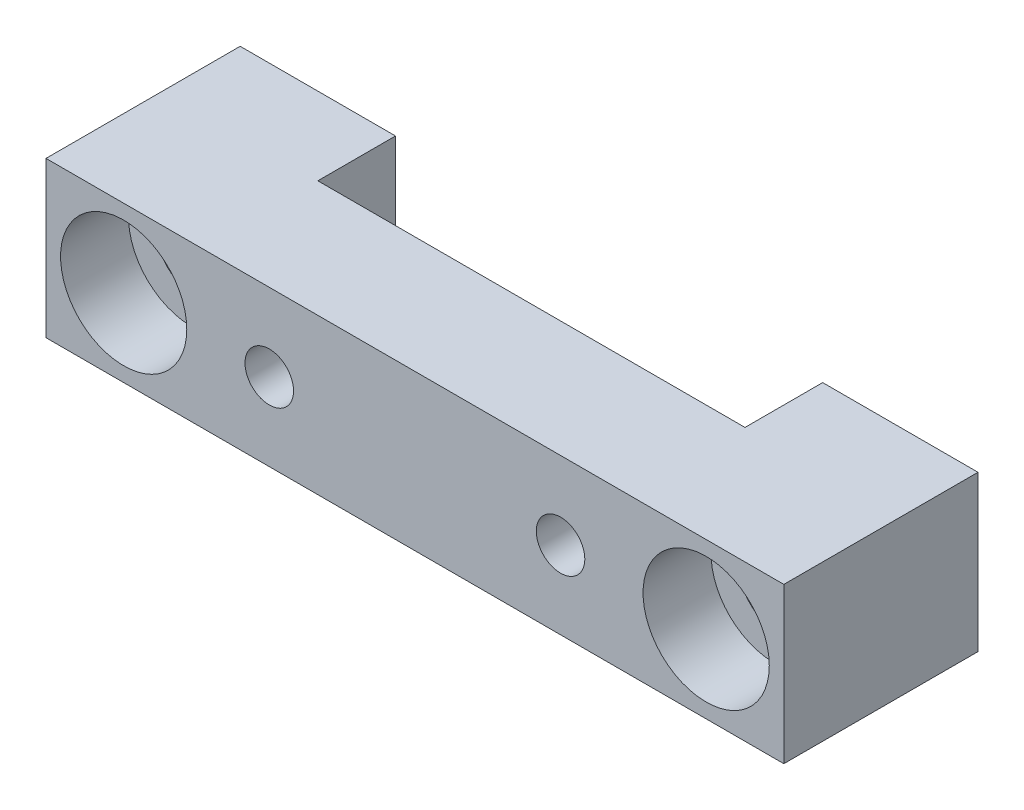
from build123d import *

# Parameters (mm, degrees)
SKETCH_1_W          = 38
SKETCH_1_H          = 8
SKETCH_1_R          = 1.75
SKETCH_1_R_2        = 1.25
EXTRUDE_1_DEPTH     = 10
SKETCH_2_R          = 3.25
CUT_EXTRUDE_1_DEPTH = 3.5
SKETCH_3_OUTSIDE_W  = 48.02
SKETCH_3_OUTSIDE_H  = 20.02
CUT_EXTRUDE_2_DEPTH = 41.099875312


with BuildPart() as part:
    # Sketch 1 → Extrude 1 (new body)
    with BuildSketch(Plane.XY):
        with Locations((19, 4)):
            Rectangle(SKETCH_1_W, SKETCH_1_H)
        with Locations((34, 4)):
            Circle(SKETCH_1_R, mode=Mode.SUBTRACT)
        with Locations((4, 4)):
            Circle(SKETCH_1_R, mode=Mode.SUBTRACT)
        with Locations((26.5, 4)):
            Circle(SKETCH_1_R_2, mode=Mode.SUBTRACT)
        with Locations((11.5, 4)):
            Circle(SKETCH_1_R_2, mode=Mode.SUBTRACT)
    extrude(amount=EXTRUDE_1_DEPTH)

    # Sketch 2 → Cut-Extrude 1 (cut)
    with BuildSketch(Plane.XY.offset(10)):
        with Locations((34, 4)):
            Circle(SKETCH_2_R)
        with Locations((4, 4)):
            Circle(SKETCH_2_R)
    extrude(amount=-CUT_EXTRUDE_1_DEPTH, mode=Mode.SUBTRACT)

    # Sketch 3 outside → Cut-Extrude 2 (cut, through all)
    with BuildSketch(Plane(origin=(0, 8, 0), x_dir=(1, 0, 0), z_dir=(0, 1, 0))):
        with Locations((19, -5)):
            Rectangle(SKETCH_3_OUTSIDE_W, SKETCH_3_OUTSIDE_H)
        Polygon((8, -4), (8, 0), (0, 0), (0, -10), (38, -10), (38, 0), (30, 0), (30, -4), align=None, mode=Mode.SUBTRACT)
    extrude(amount=-CUT_EXTRUDE_2_DEPTH, mode=Mode.SUBTRACT)


solid = part.part
